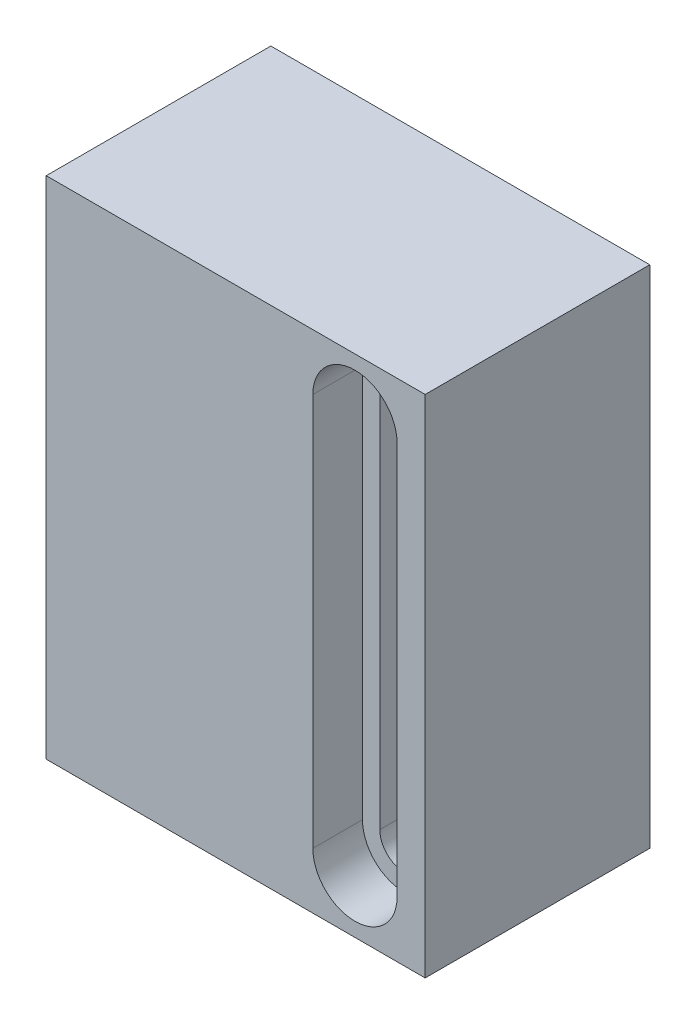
ISO-10303-21;
HEADER;
FILE_DESCRIPTION(('STEP AP214'),'2;1');
FILE_NAME('part.step','',(''),(''),'','','');
FILE_SCHEMA(('AUTOMOTIVE_DESIGN { 1 0 10303 214 1 1 1 1 }'));
ENDSEC;
DATA;
#1=APPLICATION_CONTEXT('core data for automotive mechanical design processes');
#2=APPLICATION_PROTOCOL_DEFINITION('international standard','automotive_design',2000,#1);
#3=PRODUCT_CONTEXT('',#1,'mechanical');
#4=PRODUCT('Part','Part','',(#3));
#5=PRODUCT_RELATED_PRODUCT_CATEGORY('part','',(#4));
#6=PRODUCT_DEFINITION_FORMATION('','',#4);
#7=PRODUCT_DEFINITION_CONTEXT('part definition',#1,'design');
#8=PRODUCT_DEFINITION('design','',#6,#7);
#9=PRODUCT_DEFINITION_SHAPE('','',#8);
#10=(LENGTH_UNIT() NAMED_UNIT(*) SI_UNIT(.MILLI.,.METRE.));
#11=(NAMED_UNIT(*) PLANE_ANGLE_UNIT() SI_UNIT($,.RADIAN.));
#12=(NAMED_UNIT(*) SI_UNIT($,.STERADIAN.) SOLID_ANGLE_UNIT());
#13=UNCERTAINTY_MEASURE_WITH_UNIT(LENGTH_MEASURE(1.E-05),#10,'distance_accuracy_value','');
#14=(GEOMETRIC_REPRESENTATION_CONTEXT(3) GLOBAL_UNCERTAINTY_ASSIGNED_CONTEXT((#13)) GLOBAL_UNIT_ASSIGNED_CONTEXT((#10,
#11,#12)) REPRESENTATION_CONTEXT('',''));
#15=CARTESIAN_POINT('',(0.,0.,0.));
#16=DIRECTION('',(0.,0.,1.));
#17=DIRECTION('',(1.,0.,0.));
#18=AXIS2_PLACEMENT_3D('',#15,#16,#17);
#19=CARTESIAN_POINT('',(21.4249,57.15,12.7));
#20=DIRECTION('',(-1.,0.,0.));
#21=DIRECTION('',(0.,0.,1.));
#22=AXIS2_PLACEMENT_3D('',#19,#20,#21);
#23=PLANE('',#22);
#24=DIRECTION('',(0.,0.,-1.));
#25=VECTOR('',#24,1.);
#26=CARTESIAN_POINT('',(21.4249,0.,12.7));
#27=LINE('',#26,#25);
#28=CARTESIAN_POINT('',(21.4249,0.,12.7));
#29=VERTEX_POINT('',#28);
#30=CARTESIAN_POINT('',(21.4249,0.,-12.7));
#31=VERTEX_POINT('',#30);
#32=EDGE_CURVE('E229',#29,#31,#27,.T.);
#33=ORIENTED_EDGE('',*,*,#32,.T.);
#34=DIRECTION('',(0.,-1.,0.));
#35=VECTOR('',#34,1.);
#36=CARTESIAN_POINT('',(21.4249,57.15,-12.7));
#37=LINE('',#36,#35);
#38=CARTESIAN_POINT('',(21.4249,57.15,-12.7));
#39=VERTEX_POINT('',#38);
#40=EDGE_CURVE('E262',#39,#31,#37,.T.);
#41=ORIENTED_EDGE('',*,*,#40,.F.);
#42=DIRECTION('',(0.,0.,-1.));
#43=VECTOR('',#42,1.);
#44=CARTESIAN_POINT('',(21.4249,57.15,12.7));
#45=LINE('',#44,#43);
#46=CARTESIAN_POINT('',(21.4249,57.15,12.7));
#47=VERTEX_POINT('',#46);
#48=EDGE_CURVE('E236',#47,#39,#45,.T.);
#49=ORIENTED_EDGE('',*,*,#48,.F.);
#50=DIRECTION('',(0.,-1.,0.));
#51=VECTOR('',#50,1.);
#52=CARTESIAN_POINT('',(21.4249,57.15,12.7));
#53=LINE('',#52,#51);
#54=EDGE_CURVE('E246',#47,#29,#53,.T.);
#55=ORIENTED_EDGE('',*,*,#54,.T.);
#56=EDGE_LOOP('',(#33,#41,#49,#55));
#57=FACE_BOUND('',#56,.T.);
#58=ADVANCED_FACE('F32',(#57),#23,.F.);
#59=CARTESIAN_POINT('',(-21.4249,57.15,-12.7));
#60=DIRECTION('',(0.,0.,1.));
#61=DIRECTION('',(1.,0.,0.));
#62=AXIS2_PLACEMENT_3D('',#59,#60,#61);
#63=PLANE('',#62);
#64=DIRECTION('',(0.,1.,0.));
#65=VECTOR('',#64,1.);
#66=CARTESIAN_POINT('',(8.7249,6.35,-12.7));
#67=LINE('',#66,#65);
#68=CARTESIAN_POINT('',(8.7249,6.35,-12.7));
#69=VERTEX_POINT('',#68);
#70=CARTESIAN_POINT('',(8.7249,50.8,-12.7));
#71=VERTEX_POINT('',#70);
#72=EDGE_CURVE('E187',#69,#71,#67,.T.);
#73=ORIENTED_EDGE('',*,*,#72,.F.);
#74=CARTESIAN_POINT('',(13.4874,6.35,-12.7));
#75=DIRECTION('',(0.,0.,-1.));
#76=DIRECTION('',(-1.,0.,0.));
#77=AXIS2_PLACEMENT_3D('',#74,#75,#76);
#78=CIRCLE('',#77,4.7625);
#79=CARTESIAN_POINT('',(18.2499,6.35,-12.7));
#80=VERTEX_POINT('',#79);
#81=EDGE_CURVE('E169',#80,#69,#78,.T.);
#82=ORIENTED_EDGE('',*,*,#81,.F.);
#83=DIRECTION('',(0.,-1.,0.));
#84=VECTOR('',#83,1.);
#85=CARTESIAN_POINT('',(18.2499,6.35,-12.7));
#86=LINE('',#85,#84);
#87=CARTESIAN_POINT('',(18.2499,50.8,-12.7));
#88=VERTEX_POINT('',#87);
#89=EDGE_CURVE('E176',#88,#80,#86,.T.);
#90=ORIENTED_EDGE('',*,*,#89,.F.);
#91=CARTESIAN_POINT('',(13.4874,50.8,-12.7));
#92=DIRECTION('',(0.,0.,-1.));
#93=DIRECTION('',(-1.,0.,0.));
#94=AXIS2_PLACEMENT_3D('',#91,#92,#93);
#95=CIRCLE('',#94,4.7625);
#96=EDGE_CURVE('E190',#71,#88,#95,.T.);
#97=ORIENTED_EDGE('',*,*,#96,.F.);
#98=EDGE_LOOP('',(#73,#82,#90,#97));
#99=FACE_BOUND('',#98,.T.);
#100=DIRECTION('',(-1.,0.,0.));
#101=VECTOR('',#100,1.);
#102=CARTESIAN_POINT('',(-21.4249,0.,-12.7));
#103=LINE('',#102,#101);
#104=CARTESIAN_POINT('',(-21.4249,0.,-12.7));
#105=VERTEX_POINT('',#104);
#106=EDGE_CURVE('E249',#31,#105,#103,.T.);
#107=ORIENTED_EDGE('',*,*,#106,.T.);
#108=DIRECTION('',(0.,-1.,0.));
#109=VECTOR('',#108,1.);
#110=CARTESIAN_POINT('',(-21.4249,57.15,-12.7));
#111=LINE('',#110,#109);
#112=CARTESIAN_POINT('',(-21.4249,57.15,-12.7));
#113=VERTEX_POINT('',#112);
#114=EDGE_CURVE('E259',#113,#105,#111,.T.);
#115=ORIENTED_EDGE('',*,*,#114,.F.);
#116=DIRECTION('',(-1.,0.,0.));
#117=VECTOR('',#116,1.);
#118=CARTESIAN_POINT('',(-21.4249,57.15,-12.7));
#119=LINE('',#118,#117);
#120=EDGE_CURVE('E239',#39,#113,#119,.T.);
#121=ORIENTED_EDGE('',*,*,#120,.F.);
#122=ORIENTED_EDGE('',*,*,#40,.T.);
#123=EDGE_LOOP('',(#107,#115,#121,#122));
#124=FACE_BOUND('',#123,.T.);
#125=ADVANCED_FACE('F287',(#99,#124),#63,.F.);
#126=CARTESIAN_POINT('',(-21.4249,57.15,12.7));
#127=DIRECTION('',(1.,0.,0.));
#128=DIRECTION('',(0.,0.,-1.));
#129=AXIS2_PLACEMENT_3D('',#126,#127,#128);
#130=PLANE('',#129);
#131=DIRECTION('',(0.,0.,1.));
#132=VECTOR('',#131,1.);
#133=CARTESIAN_POINT('',(-21.4249,0.,12.7));
#134=LINE('',#133,#132);
#135=CARTESIAN_POINT('',(-21.4249,0.,12.7));
#136=VERTEX_POINT('',#135);
#137=EDGE_CURVE('E251',#105,#136,#134,.T.);
#138=ORIENTED_EDGE('',*,*,#137,.T.);
#139=DIRECTION('',(0.,-1.,0.));
#140=VECTOR('',#139,1.);
#141=CARTESIAN_POINT('',(-21.4249,57.15,12.7));
#142=LINE('',#141,#140);
#143=CARTESIAN_POINT('',(-21.4249,57.15,12.7));
#144=VERTEX_POINT('',#143);
#145=EDGE_CURVE('E256',#144,#136,#142,.T.);
#146=ORIENTED_EDGE('',*,*,#145,.F.);
#147=DIRECTION('',(0.,0.,1.));
#148=VECTOR('',#147,1.);
#149=CARTESIAN_POINT('',(-21.4249,57.15,12.7));
#150=LINE('',#149,#148);
#151=EDGE_CURVE('E242',#113,#144,#150,.T.);
#152=ORIENTED_EDGE('',*,*,#151,.F.);
#153=ORIENTED_EDGE('',*,*,#114,.T.);
#154=EDGE_LOOP('',(#138,#146,#152,#153));
#155=FACE_BOUND('',#154,.T.);
#156=ADVANCED_FACE('F292',(#155),#130,.F.);
#157=CARTESIAN_POINT('',(-21.4249,57.15,12.7));
#158=DIRECTION('',(0.,0.,-1.));
#159=DIRECTION('',(-1.,0.,0.));
#160=AXIS2_PLACEMENT_3D('',#157,#158,#159);
#161=PLANE('',#160);
#162=DIRECTION('',(0.,1.,0.));
#163=VECTOR('',#162,1.);
#164=CARTESIAN_POINT('',(18.2499,6.35,12.7));
#165=LINE('',#164,#163);
#166=CARTESIAN_POINT('',(18.2499,6.35,12.7));
#167=VERTEX_POINT('',#166);
#168=CARTESIAN_POINT('',(18.2499,50.8,12.7));
#169=VERTEX_POINT('',#168);
#170=EDGE_CURVE('E219',#167,#169,#165,.T.);
#171=ORIENTED_EDGE('',*,*,#170,.F.);
#172=CARTESIAN_POINT('',(13.4874,6.35,12.7));
#173=DIRECTION('',(0.,0.,1.));
#174=DIRECTION('',(-1.,0.,0.));
#175=AXIS2_PLACEMENT_3D('',#172,#173,#174);
#176=CIRCLE('',#175,4.7625);
#177=CARTESIAN_POINT('',(8.7249,6.35,12.7));
#178=VERTEX_POINT('',#177);
#179=EDGE_CURVE('E197',#178,#167,#176,.T.);
#180=ORIENTED_EDGE('',*,*,#179,.F.);
#181=DIRECTION('',(0.,-1.,0.));
#182=VECTOR('',#181,1.);
#183=CARTESIAN_POINT('',(8.7249,6.35,12.7));
#184=LINE('',#183,#182);
#185=CARTESIAN_POINT('',(8.7249,50.8,12.7));
#186=VERTEX_POINT('',#185);
#187=EDGE_CURVE('E208',#186,#178,#184,.T.);
#188=ORIENTED_EDGE('',*,*,#187,.F.);
#189=CARTESIAN_POINT('',(13.4874,50.8,12.7));
#190=DIRECTION('',(0.,0.,1.));
#191=DIRECTION('',(-1.,0.,0.));
#192=AXIS2_PLACEMENT_3D('',#189,#190,#191);
#193=CIRCLE('',#192,4.7625);
#194=EDGE_CURVE('E222',#169,#186,#193,.T.);
#195=ORIENTED_EDGE('',*,*,#194,.F.);
#196=EDGE_LOOP('',(#171,#180,#188,#195));
#197=FACE_BOUND('',#196,.T.);
#198=DIRECTION('',(1.,0.,0.));
#199=VECTOR('',#198,1.);
#200=CARTESIAN_POINT('',(-21.4249,0.,12.7));
#201=LINE('',#200,#199);
#202=EDGE_CURVE('E240',#136,#29,#201,.T.);
#203=ORIENTED_EDGE('',*,*,#202,.T.);
#204=ORIENTED_EDGE('',*,*,#54,.F.);
#205=DIRECTION('',(1.,0.,0.));
#206=VECTOR('',#205,1.);
#207=CARTESIAN_POINT('',(-21.4249,57.15,12.7));
#208=LINE('',#207,#206);
#209=EDGE_CURVE('E244',#144,#47,#208,.T.);
#210=ORIENTED_EDGE('',*,*,#209,.F.);
#211=ORIENTED_EDGE('',*,*,#145,.T.);
#212=EDGE_LOOP('',(#203,#204,#210,#211));
#213=FACE_BOUND('',#212,.T.);
#214=ADVANCED_FACE('F310',(#197,#213),#161,.F.);
#215=CARTESIAN_POINT('',(21.4249,57.15,-12.7));
#216=DIRECTION('',(0.,-1.,0.));
#217=DIRECTION('',(0.,0.,-1.));
#218=AXIS2_PLACEMENT_3D('',#215,#216,#217);
#219=PLANE('',#218);
#220=ORIENTED_EDGE('',*,*,#48,.T.);
#221=ORIENTED_EDGE('',*,*,#120,.T.);
#222=ORIENTED_EDGE('',*,*,#151,.T.);
#223=ORIENTED_EDGE('',*,*,#209,.T.);
#224=EDGE_LOOP('',(#220,#221,#222,#223));
#225=FACE_BOUND('',#224,.T.);
#226=ADVANCED_FACE('F306',(#225),#219,.F.);
#227=CARTESIAN_POINT('',(21.4249,0.,-12.7));
#228=DIRECTION('',(0.,-1.,0.));
#229=DIRECTION('',(0.,0.,-1.));
#230=AXIS2_PLACEMENT_3D('',#227,#228,#229);
#231=PLANE('',#230);
#232=ORIENTED_EDGE('',*,*,#32,.F.);
#233=ORIENTED_EDGE('',*,*,#202,.F.);
#234=ORIENTED_EDGE('',*,*,#137,.F.);
#235=ORIENTED_EDGE('',*,*,#106,.F.);
#236=EDGE_LOOP('',(#232,#233,#234,#235));
#237=FACE_BOUND('',#236,.T.);
#238=ADVANCED_FACE('F300',(#237),#231,.T.);
#239=CARTESIAN_POINT('',(13.4874,6.35,7.0866));
#240=DIRECTION('',(0.,0.,1.));
#241=DIRECTION('',(1.,0.,0.));
#242=AXIS2_PLACEMENT_3D('',#239,#240,#241);
#243=CYLINDRICAL_SURFACE('',#242,4.7625);
#244=ORIENTED_EDGE('',*,*,#179,.T.);
#245=DIRECTION('',(0.,0.,1.));
#246=VECTOR('',#245,1.);
#247=CARTESIAN_POINT('',(18.2499,6.35,7.0866));
#248=LINE('',#247,#246);
#249=CARTESIAN_POINT('',(18.2499,6.35,7.0866));
#250=VERTEX_POINT('',#249);
#251=EDGE_CURVE('E217',#250,#167,#248,.T.);
#252=ORIENTED_EDGE('',*,*,#251,.F.);
#253=CARTESIAN_POINT('',(13.4874,6.35,7.0866));
#254=DIRECTION('',(0.,0.,1.));
#255=DIRECTION('',(-1.,0.,0.));
#256=AXIS2_PLACEMENT_3D('',#253,#254,#255);
#257=CIRCLE('',#256,4.7625);
#258=CARTESIAN_POINT('',(8.7249,6.35,7.0866));
#259=VERTEX_POINT('',#258);
#260=EDGE_CURVE('E204',#259,#250,#257,.T.);
#261=ORIENTED_EDGE('',*,*,#260,.F.);
#262=DIRECTION('',(0.,0.,1.));
#263=VECTOR('',#262,1.);
#264=CARTESIAN_POINT('',(8.7249,6.35,7.0866));
#265=LINE('',#264,#263);
#266=EDGE_CURVE('E227',#259,#178,#265,.T.);
#267=ORIENTED_EDGE('',*,*,#266,.T.);
#268=EDGE_LOOP('',(#244,#252,#261,#267));
#269=FACE_BOUND('',#268,.T.);
#270=ADVANCED_FACE('F322',(#269),#243,.F.);
#271=CARTESIAN_POINT('',(8.7249,6.35,7.0866));
#272=DIRECTION('',(-1.,0.,0.));
#273=DIRECTION('',(0.,0.,1.));
#274=AXIS2_PLACEMENT_3D('',#271,#272,#273);
#275=PLANE('',#274);
#276=ORIENTED_EDGE('',*,*,#187,.T.);
#277=ORIENTED_EDGE('',*,*,#266,.F.);
#278=DIRECTION('',(0.,-1.,0.));
#279=VECTOR('',#278,1.);
#280=CARTESIAN_POINT('',(8.7249,6.35,7.0866));
#281=LINE('',#280,#279);
#282=CARTESIAN_POINT('',(8.7249,50.8,7.0866));
#283=VERTEX_POINT('',#282);
#284=EDGE_CURVE('E214',#283,#259,#281,.T.);
#285=ORIENTED_EDGE('',*,*,#284,.F.);
#286=DIRECTION('',(0.,0.,1.));
#287=VECTOR('',#286,1.);
#288=CARTESIAN_POINT('',(8.7249,50.8,7.0866));
#289=LINE('',#288,#287);
#290=EDGE_CURVE('E230',#283,#186,#289,.T.);
#291=ORIENTED_EDGE('',*,*,#290,.T.);
#292=EDGE_LOOP('',(#276,#277,#285,#291));
#293=FACE_BOUND('',#292,.T.);
#294=ADVANCED_FACE('F327',(#293),#275,.F.);
#295=CARTESIAN_POINT('',(13.4874,50.8,7.0866));
#296=DIRECTION('',(0.,0.,1.));
#297=DIRECTION('',(1.,0.,0.));
#298=AXIS2_PLACEMENT_3D('',#295,#296,#297);
#299=CYLINDRICAL_SURFACE('',#298,4.7625);
#300=ORIENTED_EDGE('',*,*,#194,.T.);
#301=ORIENTED_EDGE('',*,*,#290,.F.);
#302=CARTESIAN_POINT('',(13.4874,50.8,7.0866));
#303=DIRECTION('',(0.,0.,1.));
#304=DIRECTION('',(-1.,0.,0.));
#305=AXIS2_PLACEMENT_3D('',#302,#303,#304);
#306=CIRCLE('',#305,4.7625);
#307=CARTESIAN_POINT('',(18.2499,50.8,7.0866));
#308=VERTEX_POINT('',#307);
#309=EDGE_CURVE('E211',#308,#283,#306,.T.);
#310=ORIENTED_EDGE('',*,*,#309,.F.);
#311=DIRECTION('',(0.,0.,1.));
#312=VECTOR('',#311,1.);
#313=CARTESIAN_POINT('',(18.2499,50.8,7.0866));
#314=LINE('',#313,#312);
#315=EDGE_CURVE('E232',#308,#169,#314,.T.);
#316=ORIENTED_EDGE('',*,*,#315,.T.);
#317=EDGE_LOOP('',(#300,#301,#310,#316));
#318=FACE_BOUND('',#317,.T.);
#319=ADVANCED_FACE('F332',(#318),#299,.F.);
#320=CARTESIAN_POINT('',(18.2499,6.35,7.0866));
#321=DIRECTION('',(1.,0.,0.));
#322=DIRECTION('',(0.,0.,-1.));
#323=AXIS2_PLACEMENT_3D('',#320,#321,#322);
#324=PLANE('',#323);
#325=ORIENTED_EDGE('',*,*,#170,.T.);
#326=ORIENTED_EDGE('',*,*,#315,.F.);
#327=DIRECTION('',(0.,1.,0.));
#328=VECTOR('',#327,1.);
#329=CARTESIAN_POINT('',(18.2499,6.35,7.0866));
#330=LINE('',#329,#328);
#331=EDGE_CURVE('E207',#250,#308,#330,.T.);
#332=ORIENTED_EDGE('',*,*,#331,.F.);
#333=ORIENTED_EDGE('',*,*,#251,.T.);
#334=EDGE_LOOP('',(#325,#326,#332,#333));
#335=FACE_BOUND('',#334,.T.);
#336=ADVANCED_FACE('F329',(#335),#324,.F.);
#337=CARTESIAN_POINT('',(13.4874,6.35,7.0866));
#338=DIRECTION('',(0.,0.,-1.));
#339=DIRECTION('',(-1.,0.,0.));
#340=AXIS2_PLACEMENT_3D('',#337,#338,#339);
#341=PLANE('',#340);
#342=DIRECTION('',(0.,-1.,0.));
#343=VECTOR('',#342,1.);
#344=CARTESIAN_POINT('',(10.6807,6.35,7.0866));
#345=LINE('',#344,#343);
#346=CARTESIAN_POINT('',(10.6807,50.8,7.0866));
#347=VERTEX_POINT('',#346);
#348=CARTESIAN_POINT('',(10.6807,6.35,7.0866));
#349=VERTEX_POINT('',#348);
#350=EDGE_CURVE('E155',#347,#349,#345,.T.);
#351=ORIENTED_EDGE('',*,*,#350,.F.);
#352=CARTESIAN_POINT('',(13.4874,50.8,7.0866));
#353=DIRECTION('',(0.,0.,1.));
#354=DIRECTION('',(-1.,0.,0.));
#355=AXIS2_PLACEMENT_3D('',#352,#353,#354);
#356=CIRCLE('',#355,2.8067);
#357=CARTESIAN_POINT('',(16.2941,50.8,7.0866));
#358=VERTEX_POINT('',#357);
#359=EDGE_CURVE('E46',#358,#347,#356,.T.);
#360=ORIENTED_EDGE('',*,*,#359,.F.);
#361=DIRECTION('',(0.,1.,0.));
#362=VECTOR('',#361,1.);
#363=CARTESIAN_POINT('',(16.2941,6.35,7.0866));
#364=LINE('',#363,#362);
#365=CARTESIAN_POINT('',(16.2941,6.35,7.0866));
#366=VERTEX_POINT('',#365);
#367=EDGE_CURVE('E162',#366,#358,#364,.T.);
#368=ORIENTED_EDGE('',*,*,#367,.F.);
#369=CARTESIAN_POINT('',(13.4874,6.35,7.0866));
#370=DIRECTION('',(0.,0.,1.));
#371=DIRECTION('',(-1.,0.,0.));
#372=AXIS2_PLACEMENT_3D('',#369,#370,#371);
#373=CIRCLE('',#372,2.8067);
#374=EDGE_CURVE('E146',#349,#366,#373,.T.);
#375=ORIENTED_EDGE('',*,*,#374,.F.);
#376=EDGE_LOOP('',(#351,#360,#368,#375));
#377=FACE_BOUND('',#376,.T.);
#378=ORIENTED_EDGE('',*,*,#260,.T.);
#379=ORIENTED_EDGE('',*,*,#331,.T.);
#380=ORIENTED_EDGE('',*,*,#309,.T.);
#381=ORIENTED_EDGE('',*,*,#284,.T.);
#382=EDGE_LOOP('',(#378,#379,#380,#381));
#383=FACE_BOUND('',#382,.T.);
#384=ADVANCED_FACE('F159',(#377,#383),#341,.F.);
#385=CARTESIAN_POINT('',(13.4874,6.35,-7.0866));
#386=DIRECTION('',(0.,0.,-1.));
#387=DIRECTION('',(-1.,0.,0.));
#388=AXIS2_PLACEMENT_3D('',#385,#386,#387);
#389=CYLINDRICAL_SURFACE('',#388,4.7625);
#390=ORIENTED_EDGE('',*,*,#81,.T.);
#391=DIRECTION('',(0.,0.,-1.));
#392=VECTOR('',#391,1.);
#393=CARTESIAN_POINT('',(8.7249,6.35,-7.0866));
#394=LINE('',#393,#392);
#395=CARTESIAN_POINT('',(8.7249,6.35,-7.0866));
#396=VERTEX_POINT('',#395);
#397=EDGE_CURVE('E185',#396,#69,#394,.T.);
#398=ORIENTED_EDGE('',*,*,#397,.F.);
#399=CARTESIAN_POINT('',(13.4874,6.35,-7.0866));
#400=DIRECTION('',(0.,0.,-1.));
#401=DIRECTION('',(-1.,0.,0.));
#402=AXIS2_PLACEMENT_3D('',#399,#400,#401);
#403=CIRCLE('',#402,4.7625);
#404=CARTESIAN_POINT('',(18.2499,6.35,-7.0866));
#405=VERTEX_POINT('',#404);
#406=EDGE_CURVE('E172',#405,#396,#403,.T.);
#407=ORIENTED_EDGE('',*,*,#406,.F.);
#408=DIRECTION('',(0.,0.,-1.));
#409=VECTOR('',#408,1.);
#410=CARTESIAN_POINT('',(18.2499,6.35,-7.0866));
#411=LINE('',#410,#409);
#412=EDGE_CURVE('E195',#405,#80,#411,.T.);
#413=ORIENTED_EDGE('',*,*,#412,.T.);
#414=EDGE_LOOP('',(#390,#398,#407,#413));
#415=FACE_BOUND('',#414,.T.);
#416=ADVANCED_FACE('F342',(#415),#389,.F.);
#417=CARTESIAN_POINT('',(18.2499,6.35,-7.0866));
#418=DIRECTION('',(1.,0.,0.));
#419=DIRECTION('',(0.,0.,-1.));
#420=AXIS2_PLACEMENT_3D('',#417,#418,#419);
#421=PLANE('',#420);
#422=ORIENTED_EDGE('',*,*,#89,.T.);
#423=ORIENTED_EDGE('',*,*,#412,.F.);
#424=DIRECTION('',(0.,-1.,0.));
#425=VECTOR('',#424,1.);
#426=CARTESIAN_POINT('',(18.2499,6.35,-7.0866));
#427=LINE('',#426,#425);
#428=CARTESIAN_POINT('',(18.2499,50.8,-7.0866));
#429=VERTEX_POINT('',#428);
#430=EDGE_CURVE('E182',#429,#405,#427,.T.);
#431=ORIENTED_EDGE('',*,*,#430,.F.);
#432=DIRECTION('',(0.,0.,-1.));
#433=VECTOR('',#432,1.);
#434=CARTESIAN_POINT('',(18.2499,50.8,-7.0866));
#435=LINE('',#434,#433);
#436=EDGE_CURVE('E198',#429,#88,#435,.T.);
#437=ORIENTED_EDGE('',*,*,#436,.T.);
#438=EDGE_LOOP('',(#422,#423,#431,#437));
#439=FACE_BOUND('',#438,.T.);
#440=ADVANCED_FACE('F345',(#439),#421,.F.);
#441=CARTESIAN_POINT('',(13.4874,50.8,-7.0866));
#442=DIRECTION('',(0.,0.,-1.));
#443=DIRECTION('',(-1.,0.,0.));
#444=AXIS2_PLACEMENT_3D('',#441,#442,#443);
#445=CYLINDRICAL_SURFACE('',#444,4.7625);
#446=ORIENTED_EDGE('',*,*,#96,.T.);
#447=ORIENTED_EDGE('',*,*,#436,.F.);
#448=CARTESIAN_POINT('',(13.4874,50.8,-7.0866));
#449=DIRECTION('',(0.,0.,-1.));
#450=DIRECTION('',(-1.,0.,0.));
#451=AXIS2_PLACEMENT_3D('',#448,#449,#450);
#452=CIRCLE('',#451,4.7625);
#453=CARTESIAN_POINT('',(8.7249,50.8,-7.0866));
#454=VERTEX_POINT('',#453);
#455=EDGE_CURVE('E179',#454,#429,#452,.T.);
#456=ORIENTED_EDGE('',*,*,#455,.F.);
#457=DIRECTION('',(0.,0.,-1.));
#458=VECTOR('',#457,1.);
#459=CARTESIAN_POINT('',(8.7249,50.8,-7.0866));
#460=LINE('',#459,#458);
#461=EDGE_CURVE('E200',#454,#71,#460,.T.);
#462=ORIENTED_EDGE('',*,*,#461,.T.);
#463=EDGE_LOOP('',(#446,#447,#456,#462));
#464=FACE_BOUND('',#463,.T.);
#465=ADVANCED_FACE('F349',(#464),#445,.F.);
#466=CARTESIAN_POINT('',(8.7249,6.35,-7.0866));
#467=DIRECTION('',(-1.,0.,0.));
#468=DIRECTION('',(0.,0.,1.));
#469=AXIS2_PLACEMENT_3D('',#466,#467,#468);
#470=PLANE('',#469);
#471=ORIENTED_EDGE('',*,*,#72,.T.);
#472=ORIENTED_EDGE('',*,*,#461,.F.);
#473=DIRECTION('',(0.,1.,0.));
#474=VECTOR('',#473,1.);
#475=CARTESIAN_POINT('',(8.7249,6.35,-7.0866));
#476=LINE('',#475,#474);
#477=EDGE_CURVE('E175',#396,#454,#476,.T.);
#478=ORIENTED_EDGE('',*,*,#477,.F.);
#479=ORIENTED_EDGE('',*,*,#397,.T.);
#480=EDGE_LOOP('',(#471,#472,#478,#479));
#481=FACE_BOUND('',#480,.T.);
#482=ADVANCED_FACE('F283',(#481),#470,.F.);
#483=CARTESIAN_POINT('',(13.4874,6.35,-7.0866));
#484=DIRECTION('',(0.,0.,-1.));
#485=DIRECTION('',(-1.,0.,0.));
#486=AXIS2_PLACEMENT_3D('',#483,#484,#485);
#487=PLANE('',#486);
#488=CARTESIAN_POINT('',(13.4874,50.8,-7.0866));
#489=DIRECTION('',(0.,0.,-1.));
#490=DIRECTION('',(-1.,0.,0.));
#491=AXIS2_PLACEMENT_3D('',#488,#489,#490);
#492=CIRCLE('',#491,2.8067);
#493=CARTESIAN_POINT('',(10.6807,50.8,-7.0866));
#494=VERTEX_POINT('',#493);
#495=CARTESIAN_POINT('',(16.2941,50.8,-7.0866));
#496=VERTEX_POINT('',#495);
#497=EDGE_CURVE('E11',#494,#496,#492,.T.);
#498=ORIENTED_EDGE('',*,*,#497,.F.);
#499=DIRECTION('',(0.,1.,0.));
#500=VECTOR('',#499,1.);
#501=CARTESIAN_POINT('',(10.6807,6.35,-7.0866));
#502=LINE('',#501,#500);
#503=CARTESIAN_POINT('',(10.6807,6.35,-7.0866));
#504=VERTEX_POINT('',#503);
#505=EDGE_CURVE('E265',#504,#494,#502,.T.);
#506=ORIENTED_EDGE('',*,*,#505,.F.);
#507=CARTESIAN_POINT('',(13.4874,6.35,-7.0866));
#508=DIRECTION('',(0.,0.,-1.));
#509=DIRECTION('',(-1.,0.,0.));
#510=AXIS2_PLACEMENT_3D('',#507,#508,#509);
#511=CIRCLE('',#510,2.8067);
#512=CARTESIAN_POINT('',(16.2941,6.35,-7.0866));
#513=VERTEX_POINT('',#512);
#514=EDGE_CURVE('E149',#513,#504,#511,.T.);
#515=ORIENTED_EDGE('',*,*,#514,.F.);
#516=DIRECTION('',(0.,-1.,0.));
#517=VECTOR('',#516,1.);
#518=CARTESIAN_POINT('',(16.2941,6.35,-7.0866));
#519=LINE('',#518,#517);
#520=EDGE_CURVE('E39',#496,#513,#519,.T.);
#521=ORIENTED_EDGE('',*,*,#520,.F.);
#522=EDGE_LOOP('',(#498,#506,#515,#521));
#523=FACE_BOUND('',#522,.T.);
#524=ORIENTED_EDGE('',*,*,#406,.T.);
#525=ORIENTED_EDGE('',*,*,#477,.T.);
#526=ORIENTED_EDGE('',*,*,#455,.T.);
#527=ORIENTED_EDGE('',*,*,#430,.T.);
#528=EDGE_LOOP('',(#524,#525,#526,#527));
#529=FACE_BOUND('',#528,.T.);
#530=ADVANCED_FACE('F273',(#523,#529),#487,.T.);
#531=CARTESIAN_POINT('',(13.4874,50.8,-12.7));
#532=DIRECTION('',(0.,0.,1.));
#533=DIRECTION('',(1.,0.,0.));
#534=AXIS2_PLACEMENT_3D('',#531,#532,#533);
#535=CYLINDRICAL_SURFACE('',#534,2.8067);
#536=ORIENTED_EDGE('',*,*,#497,.T.);
#537=DIRECTION('',(0.,0.,1.));
#538=VECTOR('',#537,1.);
#539=CARTESIAN_POINT('',(16.2941,50.8,-12.7));
#540=LINE('',#539,#538);
#541=EDGE_CURVE('E167',#496,#358,#540,.T.);
#542=ORIENTED_EDGE('',*,*,#541,.T.);
#543=ORIENTED_EDGE('',*,*,#359,.T.);
#544=DIRECTION('',(0.,0.,1.));
#545=VECTOR('',#544,1.);
#546=CARTESIAN_POINT('',(10.6807,50.8,-12.7));
#547=LINE('',#546,#545);
#548=EDGE_CURVE('E152',#494,#347,#547,.T.);
#549=ORIENTED_EDGE('',*,*,#548,.F.);
#550=EDGE_LOOP('',(#536,#542,#543,#549));
#551=FACE_BOUND('',#550,.T.);
#552=ADVANCED_FACE('F275',(#551),#535,.F.);
#553=CARTESIAN_POINT('',(16.2941,6.35,-12.7));
#554=DIRECTION('',(1.,0.,0.));
#555=DIRECTION('',(0.,1.,0.));
#556=AXIS2_PLACEMENT_3D('',#553,#554,#555);
#557=PLANE('',#556);
#558=ORIENTED_EDGE('',*,*,#520,.T.);
#559=DIRECTION('',(0.,0.,1.));
#560=VECTOR('',#559,1.);
#561=CARTESIAN_POINT('',(16.2941,6.35,-12.7));
#562=LINE('',#561,#560);
#563=EDGE_CURVE('E151',#513,#366,#562,.T.);
#564=ORIENTED_EDGE('',*,*,#563,.T.);
#565=ORIENTED_EDGE('',*,*,#367,.T.);
#566=ORIENTED_EDGE('',*,*,#541,.F.);
#567=EDGE_LOOP('',(#558,#564,#565,#566));
#568=FACE_BOUND('',#567,.T.);
#569=ADVANCED_FACE('F270',(#568),#557,.F.);
#570=CARTESIAN_POINT('',(13.4874,6.35,-12.7));
#571=DIRECTION('',(0.,0.,1.));
#572=DIRECTION('',(1.,0.,0.));
#573=AXIS2_PLACEMENT_3D('',#570,#571,#572);
#574=CYLINDRICAL_SURFACE('',#573,2.8067);
#575=ORIENTED_EDGE('',*,*,#514,.T.);
#576=DIRECTION('',(0.,0.,1.));
#577=VECTOR('',#576,1.);
#578=CARTESIAN_POINT('',(10.6807,6.35,-12.7));
#579=LINE('',#578,#577);
#580=EDGE_CURVE('E54',#504,#349,#579,.T.);
#581=ORIENTED_EDGE('',*,*,#580,.T.);
#582=ORIENTED_EDGE('',*,*,#374,.T.);
#583=ORIENTED_EDGE('',*,*,#563,.F.);
#584=EDGE_LOOP('',(#575,#581,#582,#583));
#585=FACE_BOUND('',#584,.T.);
#586=ADVANCED_FACE('F143',(#585),#574,.F.);
#587=CARTESIAN_POINT('',(10.6807,6.35,-12.7));
#588=DIRECTION('',(-1.,0.,0.));
#589=DIRECTION('',(0.,0.,1.));
#590=AXIS2_PLACEMENT_3D('',#587,#588,#589);
#591=PLANE('',#590);
#592=ORIENTED_EDGE('',*,*,#505,.T.);
#593=ORIENTED_EDGE('',*,*,#548,.T.);
#594=ORIENTED_EDGE('',*,*,#350,.T.);
#595=ORIENTED_EDGE('',*,*,#580,.F.);
#596=EDGE_LOOP('',(#592,#593,#594,#595));
#597=FACE_BOUND('',#596,.T.);
#598=ADVANCED_FACE('F156',(#597),#591,.F.);
#599=CLOSED_SHELL('',(#58,#125,#156,#214,#226,#238,#270,#294,#319,#336,#384,#416,#440,#465,#482,
#530,#552,#569,#586,#598));
#600=MANIFOLD_SOLID_BREP('B2',#599);
#601=ADVANCED_BREP_SHAPE_REPRESENTATION('',(#18,#600),#14);
#602=SHAPE_DEFINITION_REPRESENTATION(#9,#601);
ENDSEC;
END-ISO-10303-21;
